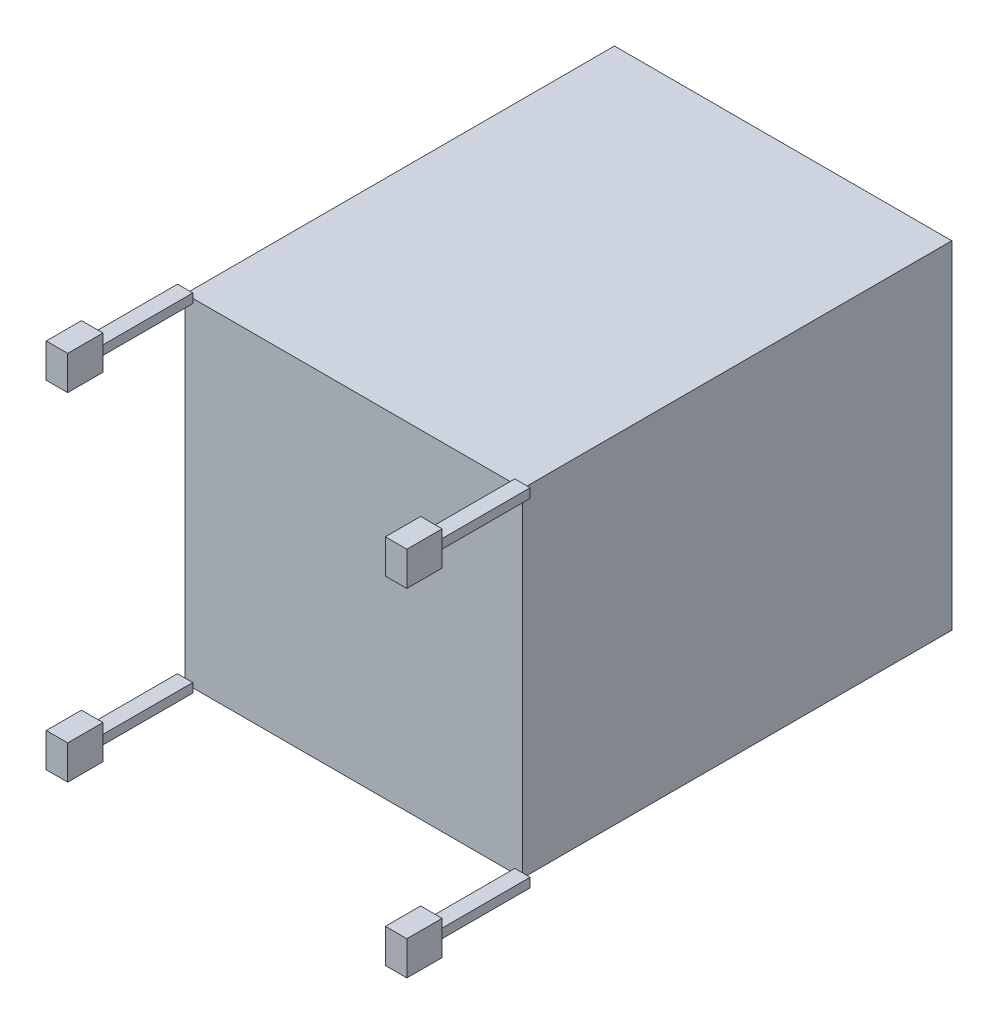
ISO-10303-21;
HEADER;
FILE_DESCRIPTION(('STEP AP214'),'2;1');
FILE_NAME('part.step','',(''),(''),'','','');
FILE_SCHEMA(('AUTOMOTIVE_DESIGN { 1 0 10303 214 1 1 1 1 }'));
ENDSEC;
DATA;
#1=APPLICATION_CONTEXT('core data for automotive mechanical design processes');
#2=APPLICATION_PROTOCOL_DEFINITION('international standard','automotive_design',2000,#1);
#3=PRODUCT_CONTEXT('',#1,'mechanical');
#4=PRODUCT('Part','Part','',(#3));
#5=PRODUCT_RELATED_PRODUCT_CATEGORY('part','',(#4));
#6=PRODUCT_DEFINITION_FORMATION('','',#4);
#7=PRODUCT_DEFINITION_CONTEXT('part definition',#1,'design');
#8=PRODUCT_DEFINITION('design','',#6,#7);
#9=PRODUCT_DEFINITION_SHAPE('','',#8);
#10=(LENGTH_UNIT() NAMED_UNIT(*) SI_UNIT(.MILLI.,.METRE.));
#11=(NAMED_UNIT(*) PLANE_ANGLE_UNIT() SI_UNIT($,.RADIAN.));
#12=(NAMED_UNIT(*) SI_UNIT($,.STERADIAN.) SOLID_ANGLE_UNIT());
#13=UNCERTAINTY_MEASURE_WITH_UNIT(LENGTH_MEASURE(1.E-05),#10,'distance_accuracy_value','');
#14=(GEOMETRIC_REPRESENTATION_CONTEXT(3) GLOBAL_UNCERTAINTY_ASSIGNED_CONTEXT((#13)) GLOBAL_UNIT_ASSIGNED_CONTEXT((#10,
#11,#12)) REPRESENTATION_CONTEXT('',''));
#15=CARTESIAN_POINT('',(0.,0.,0.));
#16=DIRECTION('',(0.,0.,1.));
#17=DIRECTION('',(1.,0.,0.));
#18=AXIS2_PLACEMENT_3D('',#15,#16,#17);
#19=CARTESIAN_POINT('',(5100.,-1000.,5400.));
#20=DIRECTION('',(0.,0.,1.));
#21=DIRECTION('',(1.,0.,0.));
#22=AXIS2_PLACEMENT_3D('',#19,#20,#21);
#23=PLANE('',#22);
#24=DIRECTION('',(-1.,0.,0.));
#25=VECTOR('',#24,1.);
#26=CARTESIAN_POINT('',(5100.,-1550.,5400.));
#27=LINE('',#26,#25);
#28=CARTESIAN_POINT('',(5650.,-1550.,5400.));
#29=VERTEX_POINT('',#28);
#30=CARTESIAN_POINT('',(4550.,-1550.,5400.));
#31=VERTEX_POINT('',#30);
#32=EDGE_CURVE('P0_E11',#29,#31,#27,.T.);
#33=ORIENTED_EDGE('',*,*,#32,.F.);
#34=DIRECTION('',(0.,-1.,0.));
#35=VECTOR('',#34,1.);
#36=CARTESIAN_POINT('',(5650.,-1000.,5400.));
#37=LINE('',#36,#35);
#38=CARTESIAN_POINT('',(5650.,-450.,5400.));
#39=VERTEX_POINT('',#38);
#40=EDGE_CURVE('P0_E61',#39,#29,#37,.T.);
#41=ORIENTED_EDGE('',*,*,#40,.F.);
#42=DIRECTION('',(1.,0.,0.));
#43=VECTOR('',#42,1.);
#44=CARTESIAN_POINT('',(5100.,-450.,5400.));
#45=LINE('',#44,#43);
#46=CARTESIAN_POINT('',(4550.,-450.,5400.));
#47=VERTEX_POINT('',#46);
#48=EDGE_CURVE('P0_E87',#47,#39,#45,.T.);
#49=ORIENTED_EDGE('',*,*,#48,.F.);
#50=DIRECTION('',(0.,1.,0.));
#51=VECTOR('',#50,1.);
#52=CARTESIAN_POINT('',(4550.,-1000.,5400.));
#53=LINE('',#52,#51);
#54=EDGE_CURVE('P0_E24',#31,#47,#53,.T.);
#55=ORIENTED_EDGE('',*,*,#54,.F.);
#56=EDGE_LOOP('',(#33,#41,#49,#55));
#57=FACE_BOUND('',#56,.T.);
#58=ADVANCED_FACE('P0_F17',(#57),#23,.T.);
#59=CARTESIAN_POINT('',(5100.,-1550.,4000.));
#60=DIRECTION('',(0.,-1.,0.));
#61=DIRECTION('',(0.,0.,-1.));
#62=AXIS2_PLACEMENT_3D('',#59,#60,#61);
#63=PLANE('',#62);
#64=DIRECTION('',(0.,0.,1.));
#65=VECTOR('',#64,1.);
#66=CARTESIAN_POINT('',(5650.,-1550.,4000.));
#67=LINE('',#66,#65);
#68=CARTESIAN_POINT('',(5650.,-1550.,4000.));
#69=VERTEX_POINT('',#68);
#70=EDGE_CURVE('P0_E53',#69,#29,#67,.T.);
#71=ORIENTED_EDGE('',*,*,#70,.T.);
#72=ORIENTED_EDGE('',*,*,#32,.T.);
#73=DIRECTION('',(0.,0.,1.));
#74=VECTOR('',#73,1.);
#75=CARTESIAN_POINT('',(4550.,-1550.,4000.));
#76=LINE('',#75,#74);
#77=CARTESIAN_POINT('',(4550.,-1550.,4000.));
#78=VERTEX_POINT('',#77);
#79=EDGE_CURVE('P0_E70',#78,#31,#76,.T.);
#80=ORIENTED_EDGE('',*,*,#79,.F.);
#81=DIRECTION('',(1.,0.,0.));
#82=VECTOR('',#81,1.);
#83=CARTESIAN_POINT('',(5100.,-1550.,4000.));
#84=LINE('',#83,#82);
#85=EDGE_CURVE('P0_E65',#78,#69,#84,.T.);
#86=ORIENTED_EDGE('',*,*,#85,.T.);
#87=EDGE_LOOP('',(#71,#72,#80,#86));
#88=FACE_BOUND('',#87,.T.);
#89=ADVANCED_FACE('P0_F66',(#88),#63,.T.);
#90=CARTESIAN_POINT('',(4550.,-1000.,4000.));
#91=DIRECTION('',(-1.,0.,0.));
#92=DIRECTION('',(0.,0.,1.));
#93=AXIS2_PLACEMENT_3D('',#90,#91,#92);
#94=PLANE('',#93);
#95=ORIENTED_EDGE('',*,*,#79,.T.);
#96=ORIENTED_EDGE('',*,*,#54,.T.);
#97=DIRECTION('',(0.,0.,1.));
#98=VECTOR('',#97,1.);
#99=CARTESIAN_POINT('',(4550.,-450.,4000.));
#100=LINE('',#99,#98);
#101=CARTESIAN_POINT('',(4550.,-450.,4000.));
#102=VERTEX_POINT('',#101);
#103=EDGE_CURVE('P0_E85',#102,#47,#100,.T.);
#104=ORIENTED_EDGE('',*,*,#103,.F.);
#105=DIRECTION('',(0.,-1.,0.));
#106=VECTOR('',#105,1.);
#107=CARTESIAN_POINT('',(4550.,-1000.,4000.));
#108=LINE('',#107,#106);
#109=EDGE_CURVE('P0_E75',#102,#78,#108,.T.);
#110=ORIENTED_EDGE('',*,*,#109,.T.);
#111=EDGE_LOOP('',(#95,#96,#104,#110));
#112=FACE_BOUND('',#111,.T.);
#113=ADVANCED_FACE('P0_F93',(#112),#94,.T.);
#114=CARTESIAN_POINT('',(5100.,-450.,4000.));
#115=DIRECTION('',(0.,1.,0.));
#116=DIRECTION('',(0.,0.,1.));
#117=AXIS2_PLACEMENT_3D('',#114,#115,#116);
#118=PLANE('',#117);
#119=ORIENTED_EDGE('',*,*,#103,.T.);
#120=ORIENTED_EDGE('',*,*,#48,.T.);
#121=DIRECTION('',(0.,0.,1.));
#122=VECTOR('',#121,1.);
#123=CARTESIAN_POINT('',(5650.,-450.,4000.));
#124=LINE('',#123,#122);
#125=CARTESIAN_POINT('',(5650.,-450.,4000.));
#126=VERTEX_POINT('',#125);
#127=EDGE_CURVE('P0_E62',#126,#39,#124,.T.);
#128=ORIENTED_EDGE('',*,*,#127,.F.);
#129=DIRECTION('',(-1.,0.,0.));
#130=VECTOR('',#129,1.);
#131=CARTESIAN_POINT('',(5100.,-450.,4000.));
#132=LINE('',#131,#130);
#133=EDGE_CURVE('P0_E76',#126,#102,#132,.T.);
#134=ORIENTED_EDGE('',*,*,#133,.T.);
#135=EDGE_LOOP('',(#119,#120,#128,#134));
#136=FACE_BOUND('',#135,.T.);
#137=ADVANCED_FACE('P0_F90',(#136),#118,.T.);
#138=CARTESIAN_POINT('',(5100.,-1000.,4000.));
#139=DIRECTION('',(0.,0.,-1.));
#140=DIRECTION('',(-1.,0.,0.));
#141=AXIS2_PLACEMENT_3D('',#138,#139,#140);
#142=PLANE('',#141);
#143=DIRECTION('',(0.,1.,0.));
#144=VECTOR('',#143,1.);
#145=CARTESIAN_POINT('',(5650.,-1000.,4000.));
#146=LINE('',#145,#144);
#147=EDGE_CURVE('P0_E56',#69,#126,#146,.T.);
#148=ORIENTED_EDGE('',*,*,#147,.F.);
#149=ORIENTED_EDGE('',*,*,#85,.F.);
#150=ORIENTED_EDGE('',*,*,#109,.F.);
#151=ORIENTED_EDGE('',*,*,#133,.F.);
#152=EDGE_LOOP('',(#148,#149,#150,#151));
#153=FACE_BOUND('',#152,.T.);
#154=ADVANCED_FACE('P0_F72',(#153),#142,.T.);
#155=CARTESIAN_POINT('',(5650.,-1000.,4000.));
#156=DIRECTION('',(1.,0.,0.));
#157=DIRECTION('',(0.,0.,-1.));
#158=AXIS2_PLACEMENT_3D('',#155,#156,#157);
#159=PLANE('',#158);
#160=ORIENTED_EDGE('',*,*,#147,.T.);
#161=ORIENTED_EDGE('',*,*,#127,.T.);
#162=ORIENTED_EDGE('',*,*,#40,.T.);
#163=ORIENTED_EDGE('',*,*,#70,.F.);
#164=EDGE_LOOP('',(#160,#161,#162,#163));
#165=FACE_BOUND('',#164,.T.);
#166=ADVANCED_FACE('P0_F57',(#165),#159,.T.);
#167=CLOSED_SHELL('',(#58,#89,#113,#137,#154,#166));
#168=MANIFOLD_SOLID_BREP('P0_B1',#167);
#169=CARTESIAN_POINT('',(4550.,-1550.,5730.));
#170=DIRECTION('',(0.,0.,1.));
#171=DIRECTION('',(1.,0.,0.));
#172=AXIS2_PLACEMENT_3D('',#169,#170,#171);
#173=PLANE('',#172);
#174=DIRECTION('',(-1.,0.,0.));
#175=VECTOR('',#174,1.);
#176=CARTESIAN_POINT('',(4550.,-1565.,5730.));
#177=LINE('',#176,#175);
#178=CARTESIAN_POINT('',(4575.,-1565.,5730.));
#179=VERTEX_POINT('',#178);
#180=CARTESIAN_POINT('',(4525.,-1565.,5730.));
#181=VERTEX_POINT('',#180);
#182=EDGE_CURVE('P1_E11',#179,#181,#177,.T.);
#183=ORIENTED_EDGE('',*,*,#182,.F.);
#184=DIRECTION('',(0.,-1.,0.));
#185=VECTOR('',#184,1.);
#186=CARTESIAN_POINT('',(4575.,-1550.,5730.));
#187=LINE('',#186,#185);
#188=CARTESIAN_POINT('',(4575.,-1535.,5730.));
#189=VERTEX_POINT('',#188);
#190=EDGE_CURVE('P1_E61',#189,#179,#187,.T.);
#191=ORIENTED_EDGE('',*,*,#190,.F.);
#192=DIRECTION('',(1.,0.,0.));
#193=VECTOR('',#192,1.);
#194=CARTESIAN_POINT('',(4550.,-1535.,5730.));
#195=LINE('',#194,#193);
#196=CARTESIAN_POINT('',(4525.,-1535.,5730.));
#197=VERTEX_POINT('',#196);
#198=EDGE_CURVE('P1_E87',#197,#189,#195,.T.);
#199=ORIENTED_EDGE('',*,*,#198,.F.);
#200=DIRECTION('',(0.,1.,0.));
#201=VECTOR('',#200,1.);
#202=CARTESIAN_POINT('',(4525.,-1550.,5730.));
#203=LINE('',#202,#201);
#204=EDGE_CURVE('P1_E24',#181,#197,#203,.T.);
#205=ORIENTED_EDGE('',*,*,#204,.F.);
#206=EDGE_LOOP('',(#183,#191,#199,#205));
#207=FACE_BOUND('',#206,.T.);
#208=ADVANCED_FACE('P1_F17',(#207),#173,.T.);
#209=CARTESIAN_POINT('',(4550.,-1565.,5400.));
#210=DIRECTION('',(0.,-1.,0.));
#211=DIRECTION('',(0.,0.,-1.));
#212=AXIS2_PLACEMENT_3D('',#209,#210,#211);
#213=PLANE('',#212);
#214=DIRECTION('',(0.,0.,1.));
#215=VECTOR('',#214,1.);
#216=CARTESIAN_POINT('',(4575.,-1565.,5400.));
#217=LINE('',#216,#215);
#218=CARTESIAN_POINT('',(4575.,-1565.,5400.));
#219=VERTEX_POINT('',#218);
#220=EDGE_CURVE('P1_E53',#219,#179,#217,.T.);
#221=ORIENTED_EDGE('',*,*,#220,.T.);
#222=ORIENTED_EDGE('',*,*,#182,.T.);
#223=DIRECTION('',(0.,0.,1.));
#224=VECTOR('',#223,1.);
#225=CARTESIAN_POINT('',(4525.,-1565.,5400.));
#226=LINE('',#225,#224);
#227=CARTESIAN_POINT('',(4525.,-1565.,5400.));
#228=VERTEX_POINT('',#227);
#229=EDGE_CURVE('P1_E70',#228,#181,#226,.T.);
#230=ORIENTED_EDGE('',*,*,#229,.F.);
#231=DIRECTION('',(1.,0.,0.));
#232=VECTOR('',#231,1.);
#233=CARTESIAN_POINT('',(4550.,-1565.,5400.));
#234=LINE('',#233,#232);
#235=EDGE_CURVE('P1_E65',#228,#219,#234,.T.);
#236=ORIENTED_EDGE('',*,*,#235,.T.);
#237=EDGE_LOOP('',(#221,#222,#230,#236));
#238=FACE_BOUND('',#237,.T.);
#239=ADVANCED_FACE('P1_F66',(#238),#213,.T.);
#240=CARTESIAN_POINT('',(4525.,-1550.,5400.));
#241=DIRECTION('',(-1.,0.,0.));
#242=DIRECTION('',(0.,0.,1.));
#243=AXIS2_PLACEMENT_3D('',#240,#241,#242);
#244=PLANE('',#243);
#245=ORIENTED_EDGE('',*,*,#229,.T.);
#246=ORIENTED_EDGE('',*,*,#204,.T.);
#247=DIRECTION('',(0.,0.,1.));
#248=VECTOR('',#247,1.);
#249=CARTESIAN_POINT('',(4525.,-1535.,5400.));
#250=LINE('',#249,#248);
#251=CARTESIAN_POINT('',(4525.,-1535.,5400.));
#252=VERTEX_POINT('',#251);
#253=EDGE_CURVE('P1_E85',#252,#197,#250,.T.);
#254=ORIENTED_EDGE('',*,*,#253,.F.);
#255=DIRECTION('',(0.,-1.,0.));
#256=VECTOR('',#255,1.);
#257=CARTESIAN_POINT('',(4525.,-1550.,5400.));
#258=LINE('',#257,#256);
#259=EDGE_CURVE('P1_E75',#252,#228,#258,.T.);
#260=ORIENTED_EDGE('',*,*,#259,.T.);
#261=EDGE_LOOP('',(#245,#246,#254,#260));
#262=FACE_BOUND('',#261,.T.);
#263=ADVANCED_FACE('P1_F93',(#262),#244,.T.);
#264=CARTESIAN_POINT('',(4550.,-1535.,5400.));
#265=DIRECTION('',(0.,1.,0.));
#266=DIRECTION('',(0.,0.,1.));
#267=AXIS2_PLACEMENT_3D('',#264,#265,#266);
#268=PLANE('',#267);
#269=ORIENTED_EDGE('',*,*,#253,.T.);
#270=ORIENTED_EDGE('',*,*,#198,.T.);
#271=DIRECTION('',(0.,0.,1.));
#272=VECTOR('',#271,1.);
#273=CARTESIAN_POINT('',(4575.,-1535.,5400.));
#274=LINE('',#273,#272);
#275=CARTESIAN_POINT('',(4575.,-1535.,5400.));
#276=VERTEX_POINT('',#275);
#277=EDGE_CURVE('P1_E62',#276,#189,#274,.T.);
#278=ORIENTED_EDGE('',*,*,#277,.F.);
#279=DIRECTION('',(-1.,0.,0.));
#280=VECTOR('',#279,1.);
#281=CARTESIAN_POINT('',(4550.,-1535.,5400.));
#282=LINE('',#281,#280);
#283=EDGE_CURVE('P1_E76',#276,#252,#282,.T.);
#284=ORIENTED_EDGE('',*,*,#283,.T.);
#285=EDGE_LOOP('',(#269,#270,#278,#284));
#286=FACE_BOUND('',#285,.T.);
#287=ADVANCED_FACE('P1_F90',(#286),#268,.T.);
#288=CARTESIAN_POINT('',(4550.,-1550.,5400.));
#289=DIRECTION('',(0.,0.,-1.));
#290=DIRECTION('',(-1.,0.,0.));
#291=AXIS2_PLACEMENT_3D('',#288,#289,#290);
#292=PLANE('',#291);
#293=DIRECTION('',(0.,1.,0.));
#294=VECTOR('',#293,1.);
#295=CARTESIAN_POINT('',(4575.,-1550.,5400.));
#296=LINE('',#295,#294);
#297=EDGE_CURVE('P1_E56',#219,#276,#296,.T.);
#298=ORIENTED_EDGE('',*,*,#297,.F.);
#299=ORIENTED_EDGE('',*,*,#235,.F.);
#300=ORIENTED_EDGE('',*,*,#259,.F.);
#301=ORIENTED_EDGE('',*,*,#283,.F.);
#302=EDGE_LOOP('',(#298,#299,#300,#301));
#303=FACE_BOUND('',#302,.T.);
#304=ADVANCED_FACE('P1_F72',(#303),#292,.T.);
#305=CARTESIAN_POINT('',(4575.,-1550.,5400.));
#306=DIRECTION('',(1.,0.,0.));
#307=DIRECTION('',(0.,0.,-1.));
#308=AXIS2_PLACEMENT_3D('',#305,#306,#307);
#309=PLANE('',#308);
#310=ORIENTED_EDGE('',*,*,#297,.T.);
#311=ORIENTED_EDGE('',*,*,#277,.T.);
#312=ORIENTED_EDGE('',*,*,#190,.T.);
#313=ORIENTED_EDGE('',*,*,#220,.F.);
#314=EDGE_LOOP('',(#310,#311,#312,#313));
#315=FACE_BOUND('',#314,.T.);
#316=ADVANCED_FACE('P1_F57',(#315),#309,.T.);
#317=CLOSED_SHELL('',(#208,#239,#263,#287,#304,#316));
#318=MANIFOLD_SOLID_BREP('P1_B1',#317);
#319=CARTESIAN_POINT('',(4547.,-1550.,5815.));
#320=DIRECTION('',(0.,0.,1.));
#321=DIRECTION('',(1.,0.,0.));
#322=AXIS2_PLACEMENT_3D('',#319,#320,#321);
#323=PLANE('',#322);
#324=DIRECTION('',(-1.,0.,0.));
#325=VECTOR('',#324,1.);
#326=CARTESIAN_POINT('',(4547.,-1605.5,5815.));
#327=LINE('',#326,#325);
#328=CARTESIAN_POINT('',(4582.,-1605.5,5815.));
#329=VERTEX_POINT('',#328);
#330=CARTESIAN_POINT('',(4512.,-1605.5,5815.));
#331=VERTEX_POINT('',#330);
#332=EDGE_CURVE('P2_E11',#329,#331,#327,.T.);
#333=ORIENTED_EDGE('',*,*,#332,.F.);
#334=DIRECTION('',(0.,-1.,0.));
#335=VECTOR('',#334,1.);
#336=CARTESIAN_POINT('',(4582.,-1550.,5815.));
#337=LINE('',#336,#335);
#338=CARTESIAN_POINT('',(4582.,-1494.5,5815.));
#339=VERTEX_POINT('',#338);
#340=EDGE_CURVE('P2_E61',#339,#329,#337,.T.);
#341=ORIENTED_EDGE('',*,*,#340,.F.);
#342=DIRECTION('',(1.,0.,0.));
#343=VECTOR('',#342,1.);
#344=CARTESIAN_POINT('',(4547.,-1494.5,5815.));
#345=LINE('',#344,#343);
#346=CARTESIAN_POINT('',(4512.,-1494.5,5815.));
#347=VERTEX_POINT('',#346);
#348=EDGE_CURVE('P2_E87',#347,#339,#345,.T.);
#349=ORIENTED_EDGE('',*,*,#348,.F.);
#350=DIRECTION('',(0.,1.,0.));
#351=VECTOR('',#350,1.);
#352=CARTESIAN_POINT('',(4512.,-1550.,5815.));
#353=LINE('',#352,#351);
#354=EDGE_CURVE('P2_E24',#331,#347,#353,.T.);
#355=ORIENTED_EDGE('',*,*,#354,.F.);
#356=EDGE_LOOP('',(#333,#341,#349,#355));
#357=FACE_BOUND('',#356,.T.);
#358=ADVANCED_FACE('P2_F17',(#357),#323,.T.);
#359=CARTESIAN_POINT('',(4547.,-1605.5,5700.));
#360=DIRECTION('',(0.,-1.,0.));
#361=DIRECTION('',(0.,0.,-1.));
#362=AXIS2_PLACEMENT_3D('',#359,#360,#361);
#363=PLANE('',#362);
#364=DIRECTION('',(0.,0.,1.));
#365=VECTOR('',#364,1.);
#366=CARTESIAN_POINT('',(4582.,-1605.5,5700.));
#367=LINE('',#366,#365);
#368=CARTESIAN_POINT('',(4582.,-1605.5,5700.));
#369=VERTEX_POINT('',#368);
#370=EDGE_CURVE('P2_E53',#369,#329,#367,.T.);
#371=ORIENTED_EDGE('',*,*,#370,.T.);
#372=ORIENTED_EDGE('',*,*,#332,.T.);
#373=DIRECTION('',(0.,0.,1.));
#374=VECTOR('',#373,1.);
#375=CARTESIAN_POINT('',(4512.,-1605.5,5700.));
#376=LINE('',#375,#374);
#377=CARTESIAN_POINT('',(4512.,-1605.5,5700.));
#378=VERTEX_POINT('',#377);
#379=EDGE_CURVE('P2_E70',#378,#331,#376,.T.);
#380=ORIENTED_EDGE('',*,*,#379,.F.);
#381=DIRECTION('',(1.,0.,0.));
#382=VECTOR('',#381,1.);
#383=CARTESIAN_POINT('',(4547.,-1605.5,5700.));
#384=LINE('',#383,#382);
#385=EDGE_CURVE('P2_E65',#378,#369,#384,.T.);
#386=ORIENTED_EDGE('',*,*,#385,.T.);
#387=EDGE_LOOP('',(#371,#372,#380,#386));
#388=FACE_BOUND('',#387,.T.);
#389=ADVANCED_FACE('P2_F66',(#388),#363,.T.);
#390=CARTESIAN_POINT('',(4512.,-1550.,5700.));
#391=DIRECTION('',(-1.,0.,0.));
#392=DIRECTION('',(0.,0.,1.));
#393=AXIS2_PLACEMENT_3D('',#390,#391,#392);
#394=PLANE('',#393);
#395=ORIENTED_EDGE('',*,*,#379,.T.);
#396=ORIENTED_EDGE('',*,*,#354,.T.);
#397=DIRECTION('',(0.,0.,1.));
#398=VECTOR('',#397,1.);
#399=CARTESIAN_POINT('',(4512.,-1494.5,5700.));
#400=LINE('',#399,#398);
#401=CARTESIAN_POINT('',(4512.,-1494.5,5700.));
#402=VERTEX_POINT('',#401);
#403=EDGE_CURVE('P2_E85',#402,#347,#400,.T.);
#404=ORIENTED_EDGE('',*,*,#403,.F.);
#405=DIRECTION('',(0.,-1.,0.));
#406=VECTOR('',#405,1.);
#407=CARTESIAN_POINT('',(4512.,-1550.,5700.));
#408=LINE('',#407,#406);
#409=EDGE_CURVE('P2_E75',#402,#378,#408,.T.);
#410=ORIENTED_EDGE('',*,*,#409,.T.);
#411=EDGE_LOOP('',(#395,#396,#404,#410));
#412=FACE_BOUND('',#411,.T.);
#413=ADVANCED_FACE('P2_F93',(#412),#394,.T.);
#414=CARTESIAN_POINT('',(4547.,-1494.5,5700.));
#415=DIRECTION('',(0.,1.,0.));
#416=DIRECTION('',(0.,0.,1.));
#417=AXIS2_PLACEMENT_3D('',#414,#415,#416);
#418=PLANE('',#417);
#419=ORIENTED_EDGE('',*,*,#403,.T.);
#420=ORIENTED_EDGE('',*,*,#348,.T.);
#421=DIRECTION('',(0.,0.,1.));
#422=VECTOR('',#421,1.);
#423=CARTESIAN_POINT('',(4582.,-1494.5,5700.));
#424=LINE('',#423,#422);
#425=CARTESIAN_POINT('',(4582.,-1494.5,5700.));
#426=VERTEX_POINT('',#425);
#427=EDGE_CURVE('P2_E62',#426,#339,#424,.T.);
#428=ORIENTED_EDGE('',*,*,#427,.F.);
#429=DIRECTION('',(-1.,0.,0.));
#430=VECTOR('',#429,1.);
#431=CARTESIAN_POINT('',(4547.,-1494.5,5700.));
#432=LINE('',#431,#430);
#433=EDGE_CURVE('P2_E76',#426,#402,#432,.T.);
#434=ORIENTED_EDGE('',*,*,#433,.T.);
#435=EDGE_LOOP('',(#419,#420,#428,#434));
#436=FACE_BOUND('',#435,.T.);
#437=ADVANCED_FACE('P2_F90',(#436),#418,.T.);
#438=CARTESIAN_POINT('',(4547.,-1550.,5700.));
#439=DIRECTION('',(0.,0.,-1.));
#440=DIRECTION('',(-1.,0.,0.));
#441=AXIS2_PLACEMENT_3D('',#438,#439,#440);
#442=PLANE('',#441);
#443=DIRECTION('',(0.,1.,0.));
#444=VECTOR('',#443,1.);
#445=CARTESIAN_POINT('',(4582.,-1550.,5700.));
#446=LINE('',#445,#444);
#447=EDGE_CURVE('P2_E56',#369,#426,#446,.T.);
#448=ORIENTED_EDGE('',*,*,#447,.F.);
#449=ORIENTED_EDGE('',*,*,#385,.F.);
#450=ORIENTED_EDGE('',*,*,#409,.F.);
#451=ORIENTED_EDGE('',*,*,#433,.F.);
#452=EDGE_LOOP('',(#448,#449,#450,#451));
#453=FACE_BOUND('',#452,.T.);
#454=ADVANCED_FACE('P2_F72',(#453),#442,.T.);
#455=CARTESIAN_POINT('',(4582.,-1550.,5700.));
#456=DIRECTION('',(1.,0.,0.));
#457=DIRECTION('',(0.,0.,-1.));
#458=AXIS2_PLACEMENT_3D('',#455,#456,#457);
#459=PLANE('',#458);
#460=ORIENTED_EDGE('',*,*,#447,.T.);
#461=ORIENTED_EDGE('',*,*,#427,.T.);
#462=ORIENTED_EDGE('',*,*,#340,.T.);
#463=ORIENTED_EDGE('',*,*,#370,.F.);
#464=EDGE_LOOP('',(#460,#461,#462,#463));
#465=FACE_BOUND('',#464,.T.);
#466=ADVANCED_FACE('P2_F57',(#465),#459,.T.);
#467=CLOSED_SHELL('',(#358,#389,#413,#437,#454,#466));
#468=MANIFOLD_SOLID_BREP('P2_B1',#467);
#469=CARTESIAN_POINT('',(4550.,-450.,5730.));
#470=DIRECTION('',(0.,0.,1.));
#471=DIRECTION('',(1.,0.,0.));
#472=AXIS2_PLACEMENT_3D('',#469,#470,#471);
#473=PLANE('',#472);
#474=DIRECTION('',(-1.,0.,0.));
#475=VECTOR('',#474,1.);
#476=CARTESIAN_POINT('',(4550.,-465.,5730.));
#477=LINE('',#476,#475);
#478=CARTESIAN_POINT('',(4575.,-465.,5730.));
#479=VERTEX_POINT('',#478);
#480=CARTESIAN_POINT('',(4525.,-465.,5730.));
#481=VERTEX_POINT('',#480);
#482=EDGE_CURVE('P3_E11',#479,#481,#477,.T.);
#483=ORIENTED_EDGE('',*,*,#482,.F.);
#484=DIRECTION('',(0.,-1.,0.));
#485=VECTOR('',#484,1.);
#486=CARTESIAN_POINT('',(4575.,-450.,5730.));
#487=LINE('',#486,#485);
#488=CARTESIAN_POINT('',(4575.,-435.,5730.));
#489=VERTEX_POINT('',#488);
#490=EDGE_CURVE('P3_E61',#489,#479,#487,.T.);
#491=ORIENTED_EDGE('',*,*,#490,.F.);
#492=DIRECTION('',(1.,0.,0.));
#493=VECTOR('',#492,1.);
#494=CARTESIAN_POINT('',(4550.,-435.,5730.));
#495=LINE('',#494,#493);
#496=CARTESIAN_POINT('',(4525.,-435.,5730.));
#497=VERTEX_POINT('',#496);
#498=EDGE_CURVE('P3_E87',#497,#489,#495,.T.);
#499=ORIENTED_EDGE('',*,*,#498,.F.);
#500=DIRECTION('',(0.,1.,0.));
#501=VECTOR('',#500,1.);
#502=CARTESIAN_POINT('',(4525.,-450.,5730.));
#503=LINE('',#502,#501);
#504=EDGE_CURVE('P3_E24',#481,#497,#503,.T.);
#505=ORIENTED_EDGE('',*,*,#504,.F.);
#506=EDGE_LOOP('',(#483,#491,#499,#505));
#507=FACE_BOUND('',#506,.T.);
#508=ADVANCED_FACE('P3_F17',(#507),#473,.T.);
#509=CARTESIAN_POINT('',(4550.,-465.,5400.));
#510=DIRECTION('',(0.,-1.,0.));
#511=DIRECTION('',(0.,0.,-1.));
#512=AXIS2_PLACEMENT_3D('',#509,#510,#511);
#513=PLANE('',#512);
#514=DIRECTION('',(0.,0.,1.));
#515=VECTOR('',#514,1.);
#516=CARTESIAN_POINT('',(4575.,-465.,5400.));
#517=LINE('',#516,#515);
#518=CARTESIAN_POINT('',(4575.,-465.,5400.));
#519=VERTEX_POINT('',#518);
#520=EDGE_CURVE('P3_E53',#519,#479,#517,.T.);
#521=ORIENTED_EDGE('',*,*,#520,.T.);
#522=ORIENTED_EDGE('',*,*,#482,.T.);
#523=DIRECTION('',(0.,0.,1.));
#524=VECTOR('',#523,1.);
#525=CARTESIAN_POINT('',(4525.,-465.,5400.));
#526=LINE('',#525,#524);
#527=CARTESIAN_POINT('',(4525.,-465.,5400.));
#528=VERTEX_POINT('',#527);
#529=EDGE_CURVE('P3_E70',#528,#481,#526,.T.);
#530=ORIENTED_EDGE('',*,*,#529,.F.);
#531=DIRECTION('',(1.,0.,0.));
#532=VECTOR('',#531,1.);
#533=CARTESIAN_POINT('',(4550.,-465.,5400.));
#534=LINE('',#533,#532);
#535=EDGE_CURVE('P3_E65',#528,#519,#534,.T.);
#536=ORIENTED_EDGE('',*,*,#535,.T.);
#537=EDGE_LOOP('',(#521,#522,#530,#536));
#538=FACE_BOUND('',#537,.T.);
#539=ADVANCED_FACE('P3_F66',(#538),#513,.T.);
#540=CARTESIAN_POINT('',(4525.,-450.,5400.));
#541=DIRECTION('',(-1.,0.,0.));
#542=DIRECTION('',(0.,0.,1.));
#543=AXIS2_PLACEMENT_3D('',#540,#541,#542);
#544=PLANE('',#543);
#545=ORIENTED_EDGE('',*,*,#529,.T.);
#546=ORIENTED_EDGE('',*,*,#504,.T.);
#547=DIRECTION('',(0.,0.,1.));
#548=VECTOR('',#547,1.);
#549=CARTESIAN_POINT('',(4525.,-435.,5400.));
#550=LINE('',#549,#548);
#551=CARTESIAN_POINT('',(4525.,-435.,5400.));
#552=VERTEX_POINT('',#551);
#553=EDGE_CURVE('P3_E85',#552,#497,#550,.T.);
#554=ORIENTED_EDGE('',*,*,#553,.F.);
#555=DIRECTION('',(0.,-1.,0.));
#556=VECTOR('',#555,1.);
#557=CARTESIAN_POINT('',(4525.,-450.,5400.));
#558=LINE('',#557,#556);
#559=EDGE_CURVE('P3_E75',#552,#528,#558,.T.);
#560=ORIENTED_EDGE('',*,*,#559,.T.);
#561=EDGE_LOOP('',(#545,#546,#554,#560));
#562=FACE_BOUND('',#561,.T.);
#563=ADVANCED_FACE('P3_F93',(#562),#544,.T.);
#564=CARTESIAN_POINT('',(4550.,-435.,5400.));
#565=DIRECTION('',(0.,1.,0.));
#566=DIRECTION('',(0.,0.,1.));
#567=AXIS2_PLACEMENT_3D('',#564,#565,#566);
#568=PLANE('',#567);
#569=ORIENTED_EDGE('',*,*,#553,.T.);
#570=ORIENTED_EDGE('',*,*,#498,.T.);
#571=DIRECTION('',(0.,0.,1.));
#572=VECTOR('',#571,1.);
#573=CARTESIAN_POINT('',(4575.,-435.,5400.));
#574=LINE('',#573,#572);
#575=CARTESIAN_POINT('',(4575.,-435.,5400.));
#576=VERTEX_POINT('',#575);
#577=EDGE_CURVE('P3_E62',#576,#489,#574,.T.);
#578=ORIENTED_EDGE('',*,*,#577,.F.);
#579=DIRECTION('',(-1.,0.,0.));
#580=VECTOR('',#579,1.);
#581=CARTESIAN_POINT('',(4550.,-435.,5400.));
#582=LINE('',#581,#580);
#583=EDGE_CURVE('P3_E76',#576,#552,#582,.T.);
#584=ORIENTED_EDGE('',*,*,#583,.T.);
#585=EDGE_LOOP('',(#569,#570,#578,#584));
#586=FACE_BOUND('',#585,.T.);
#587=ADVANCED_FACE('P3_F90',(#586),#568,.T.);
#588=CARTESIAN_POINT('',(4550.,-450.,5400.));
#589=DIRECTION('',(0.,0.,-1.));
#590=DIRECTION('',(-1.,0.,0.));
#591=AXIS2_PLACEMENT_3D('',#588,#589,#590);
#592=PLANE('',#591);
#593=DIRECTION('',(0.,1.,0.));
#594=VECTOR('',#593,1.);
#595=CARTESIAN_POINT('',(4575.,-450.,5400.));
#596=LINE('',#595,#594);
#597=EDGE_CURVE('P3_E56',#519,#576,#596,.T.);
#598=ORIENTED_EDGE('',*,*,#597,.F.);
#599=ORIENTED_EDGE('',*,*,#535,.F.);
#600=ORIENTED_EDGE('',*,*,#559,.F.);
#601=ORIENTED_EDGE('',*,*,#583,.F.);
#602=EDGE_LOOP('',(#598,#599,#600,#601));
#603=FACE_BOUND('',#602,.T.);
#604=ADVANCED_FACE('P3_F72',(#603),#592,.T.);
#605=CARTESIAN_POINT('',(4575.,-450.,5400.));
#606=DIRECTION('',(1.,0.,0.));
#607=DIRECTION('',(0.,0.,-1.));
#608=AXIS2_PLACEMENT_3D('',#605,#606,#607);
#609=PLANE('',#608);
#610=ORIENTED_EDGE('',*,*,#597,.T.);
#611=ORIENTED_EDGE('',*,*,#577,.T.);
#612=ORIENTED_EDGE('',*,*,#490,.T.);
#613=ORIENTED_EDGE('',*,*,#520,.F.);
#614=EDGE_LOOP('',(#610,#611,#612,#613));
#615=FACE_BOUND('',#614,.T.);
#616=ADVANCED_FACE('P3_F57',(#615),#609,.T.);
#617=CLOSED_SHELL('',(#508,#539,#563,#587,#604,#616));
#618=MANIFOLD_SOLID_BREP('P3_B1',#617);
#619=CARTESIAN_POINT('',(4547.,-450.,5815.));
#620=DIRECTION('',(0.,0.,1.));
#621=DIRECTION('',(1.,0.,0.));
#622=AXIS2_PLACEMENT_3D('',#619,#620,#621);
#623=PLANE('',#622);
#624=DIRECTION('',(-1.,0.,0.));
#625=VECTOR('',#624,1.);
#626=CARTESIAN_POINT('',(4547.,-505.5,5815.));
#627=LINE('',#626,#625);
#628=CARTESIAN_POINT('',(4582.,-505.5,5815.));
#629=VERTEX_POINT('',#628);
#630=CARTESIAN_POINT('',(4512.,-505.5,5815.));
#631=VERTEX_POINT('',#630);
#632=EDGE_CURVE('P4_E11',#629,#631,#627,.T.);
#633=ORIENTED_EDGE('',*,*,#632,.F.);
#634=DIRECTION('',(0.,-1.,0.));
#635=VECTOR('',#634,1.);
#636=CARTESIAN_POINT('',(4582.,-450.,5815.));
#637=LINE('',#636,#635);
#638=CARTESIAN_POINT('',(4582.,-394.5,5815.));
#639=VERTEX_POINT('',#638);
#640=EDGE_CURVE('P4_E61',#639,#629,#637,.T.);
#641=ORIENTED_EDGE('',*,*,#640,.F.);
#642=DIRECTION('',(1.,0.,0.));
#643=VECTOR('',#642,1.);
#644=CARTESIAN_POINT('',(4547.,-394.5,5815.));
#645=LINE('',#644,#643);
#646=CARTESIAN_POINT('',(4512.,-394.5,5815.));
#647=VERTEX_POINT('',#646);
#648=EDGE_CURVE('P4_E87',#647,#639,#645,.T.);
#649=ORIENTED_EDGE('',*,*,#648,.F.);
#650=DIRECTION('',(0.,1.,0.));
#651=VECTOR('',#650,1.);
#652=CARTESIAN_POINT('',(4512.,-450.,5815.));
#653=LINE('',#652,#651);
#654=EDGE_CURVE('P4_E24',#631,#647,#653,.T.);
#655=ORIENTED_EDGE('',*,*,#654,.F.);
#656=EDGE_LOOP('',(#633,#641,#649,#655));
#657=FACE_BOUND('',#656,.T.);
#658=ADVANCED_FACE('P4_F17',(#657),#623,.T.);
#659=CARTESIAN_POINT('',(4547.,-505.5,5700.));
#660=DIRECTION('',(0.,-1.,0.));
#661=DIRECTION('',(0.,0.,-1.));
#662=AXIS2_PLACEMENT_3D('',#659,#660,#661);
#663=PLANE('',#662);
#664=DIRECTION('',(0.,0.,1.));
#665=VECTOR('',#664,1.);
#666=CARTESIAN_POINT('',(4582.,-505.5,5700.));
#667=LINE('',#666,#665);
#668=CARTESIAN_POINT('',(4582.,-505.5,5700.));
#669=VERTEX_POINT('',#668);
#670=EDGE_CURVE('P4_E53',#669,#629,#667,.T.);
#671=ORIENTED_EDGE('',*,*,#670,.T.);
#672=ORIENTED_EDGE('',*,*,#632,.T.);
#673=DIRECTION('',(0.,0.,1.));
#674=VECTOR('',#673,1.);
#675=CARTESIAN_POINT('',(4512.,-505.5,5700.));
#676=LINE('',#675,#674);
#677=CARTESIAN_POINT('',(4512.,-505.5,5700.));
#678=VERTEX_POINT('',#677);
#679=EDGE_CURVE('P4_E70',#678,#631,#676,.T.);
#680=ORIENTED_EDGE('',*,*,#679,.F.);
#681=DIRECTION('',(1.,0.,0.));
#682=VECTOR('',#681,1.);
#683=CARTESIAN_POINT('',(4547.,-505.5,5700.));
#684=LINE('',#683,#682);
#685=EDGE_CURVE('P4_E65',#678,#669,#684,.T.);
#686=ORIENTED_EDGE('',*,*,#685,.T.);
#687=EDGE_LOOP('',(#671,#672,#680,#686));
#688=FACE_BOUND('',#687,.T.);
#689=ADVANCED_FACE('P4_F66',(#688),#663,.T.);
#690=CARTESIAN_POINT('',(4512.,-450.,5700.));
#691=DIRECTION('',(-1.,0.,0.));
#692=DIRECTION('',(0.,0.,1.));
#693=AXIS2_PLACEMENT_3D('',#690,#691,#692);
#694=PLANE('',#693);
#695=ORIENTED_EDGE('',*,*,#679,.T.);
#696=ORIENTED_EDGE('',*,*,#654,.T.);
#697=DIRECTION('',(0.,0.,1.));
#698=VECTOR('',#697,1.);
#699=CARTESIAN_POINT('',(4512.,-394.5,5700.));
#700=LINE('',#699,#698);
#701=CARTESIAN_POINT('',(4512.,-394.5,5700.));
#702=VERTEX_POINT('',#701);
#703=EDGE_CURVE('P4_E85',#702,#647,#700,.T.);
#704=ORIENTED_EDGE('',*,*,#703,.F.);
#705=DIRECTION('',(0.,-1.,0.));
#706=VECTOR('',#705,1.);
#707=CARTESIAN_POINT('',(4512.,-450.,5700.));
#708=LINE('',#707,#706);
#709=EDGE_CURVE('P4_E75',#702,#678,#708,.T.);
#710=ORIENTED_EDGE('',*,*,#709,.T.);
#711=EDGE_LOOP('',(#695,#696,#704,#710));
#712=FACE_BOUND('',#711,.T.);
#713=ADVANCED_FACE('P4_F93',(#712),#694,.T.);
#714=CARTESIAN_POINT('',(4547.,-394.5,5700.));
#715=DIRECTION('',(0.,1.,0.));
#716=DIRECTION('',(0.,0.,1.));
#717=AXIS2_PLACEMENT_3D('',#714,#715,#716);
#718=PLANE('',#717);
#719=ORIENTED_EDGE('',*,*,#703,.T.);
#720=ORIENTED_EDGE('',*,*,#648,.T.);
#721=DIRECTION('',(0.,0.,1.));
#722=VECTOR('',#721,1.);
#723=CARTESIAN_POINT('',(4582.,-394.5,5700.));
#724=LINE('',#723,#722);
#725=CARTESIAN_POINT('',(4582.,-394.5,5700.));
#726=VERTEX_POINT('',#725);
#727=EDGE_CURVE('P4_E62',#726,#639,#724,.T.);
#728=ORIENTED_EDGE('',*,*,#727,.F.);
#729=DIRECTION('',(-1.,0.,0.));
#730=VECTOR('',#729,1.);
#731=CARTESIAN_POINT('',(4547.,-394.5,5700.));
#732=LINE('',#731,#730);
#733=EDGE_CURVE('P4_E76',#726,#702,#732,.T.);
#734=ORIENTED_EDGE('',*,*,#733,.T.);
#735=EDGE_LOOP('',(#719,#720,#728,#734));
#736=FACE_BOUND('',#735,.T.);
#737=ADVANCED_FACE('P4_F90',(#736),#718,.T.);
#738=CARTESIAN_POINT('',(4547.,-450.,5700.));
#739=DIRECTION('',(0.,0.,-1.));
#740=DIRECTION('',(-1.,0.,0.));
#741=AXIS2_PLACEMENT_3D('',#738,#739,#740);
#742=PLANE('',#741);
#743=DIRECTION('',(0.,1.,0.));
#744=VECTOR('',#743,1.);
#745=CARTESIAN_POINT('',(4582.,-450.,5700.));
#746=LINE('',#745,#744);
#747=EDGE_CURVE('P4_E56',#669,#726,#746,.T.);
#748=ORIENTED_EDGE('',*,*,#747,.F.);
#749=ORIENTED_EDGE('',*,*,#685,.F.);
#750=ORIENTED_EDGE('',*,*,#709,.F.);
#751=ORIENTED_EDGE('',*,*,#733,.F.);
#752=EDGE_LOOP('',(#748,#749,#750,#751));
#753=FACE_BOUND('',#752,.T.);
#754=ADVANCED_FACE('P4_F72',(#753),#742,.T.);
#755=CARTESIAN_POINT('',(4582.,-450.,5700.));
#756=DIRECTION('',(1.,0.,0.));
#757=DIRECTION('',(0.,0.,-1.));
#758=AXIS2_PLACEMENT_3D('',#755,#756,#757);
#759=PLANE('',#758);
#760=ORIENTED_EDGE('',*,*,#747,.T.);
#761=ORIENTED_EDGE('',*,*,#727,.T.);
#762=ORIENTED_EDGE('',*,*,#640,.T.);
#763=ORIENTED_EDGE('',*,*,#670,.F.);
#764=EDGE_LOOP('',(#760,#761,#762,#763));
#765=FACE_BOUND('',#764,.T.);
#766=ADVANCED_FACE('P4_F57',(#765),#759,.T.);
#767=CLOSED_SHELL('',(#658,#689,#713,#737,#754,#766));
#768=MANIFOLD_SOLID_BREP('P4_B1',#767);
#769=CARTESIAN_POINT('',(5650.,-1550.,5730.));
#770=DIRECTION('',(0.,0.,1.));
#771=DIRECTION('',(1.,0.,0.));
#772=AXIS2_PLACEMENT_3D('',#769,#770,#771);
#773=PLANE('',#772);
#774=DIRECTION('',(-1.,0.,0.));
#775=VECTOR('',#774,1.);
#776=CARTESIAN_POINT('',(5650.,-1565.,5730.));
#777=LINE('',#776,#775);
#778=CARTESIAN_POINT('',(5675.,-1565.,5730.));
#779=VERTEX_POINT('',#778);
#780=CARTESIAN_POINT('',(5625.,-1565.,5730.));
#781=VERTEX_POINT('',#780);
#782=EDGE_CURVE('P5_E11',#779,#781,#777,.T.);
#783=ORIENTED_EDGE('',*,*,#782,.F.);
#784=DIRECTION('',(0.,-1.,0.));
#785=VECTOR('',#784,1.);
#786=CARTESIAN_POINT('',(5675.,-1550.,5730.));
#787=LINE('',#786,#785);
#788=CARTESIAN_POINT('',(5675.,-1535.,5730.));
#789=VERTEX_POINT('',#788);
#790=EDGE_CURVE('P5_E61',#789,#779,#787,.T.);
#791=ORIENTED_EDGE('',*,*,#790,.F.);
#792=DIRECTION('',(1.,0.,0.));
#793=VECTOR('',#792,1.);
#794=CARTESIAN_POINT('',(5650.,-1535.,5730.));
#795=LINE('',#794,#793);
#796=CARTESIAN_POINT('',(5625.,-1535.,5730.));
#797=VERTEX_POINT('',#796);
#798=EDGE_CURVE('P5_E87',#797,#789,#795,.T.);
#799=ORIENTED_EDGE('',*,*,#798,.F.);
#800=DIRECTION('',(0.,1.,0.));
#801=VECTOR('',#800,1.);
#802=CARTESIAN_POINT('',(5625.,-1550.,5730.));
#803=LINE('',#802,#801);
#804=EDGE_CURVE('P5_E24',#781,#797,#803,.T.);
#805=ORIENTED_EDGE('',*,*,#804,.F.);
#806=EDGE_LOOP('',(#783,#791,#799,#805));
#807=FACE_BOUND('',#806,.T.);
#808=ADVANCED_FACE('P5_F17',(#807),#773,.T.);
#809=CARTESIAN_POINT('',(5650.,-1565.,5400.));
#810=DIRECTION('',(0.,-1.,0.));
#811=DIRECTION('',(0.,0.,-1.));
#812=AXIS2_PLACEMENT_3D('',#809,#810,#811);
#813=PLANE('',#812);
#814=DIRECTION('',(0.,0.,1.));
#815=VECTOR('',#814,1.);
#816=CARTESIAN_POINT('',(5675.,-1565.,5400.));
#817=LINE('',#816,#815);
#818=CARTESIAN_POINT('',(5675.,-1565.,5400.));
#819=VERTEX_POINT('',#818);
#820=EDGE_CURVE('P5_E53',#819,#779,#817,.T.);
#821=ORIENTED_EDGE('',*,*,#820,.T.);
#822=ORIENTED_EDGE('',*,*,#782,.T.);
#823=DIRECTION('',(0.,0.,1.));
#824=VECTOR('',#823,1.);
#825=CARTESIAN_POINT('',(5625.,-1565.,5400.));
#826=LINE('',#825,#824);
#827=CARTESIAN_POINT('',(5625.,-1565.,5400.));
#828=VERTEX_POINT('',#827);
#829=EDGE_CURVE('P5_E70',#828,#781,#826,.T.);
#830=ORIENTED_EDGE('',*,*,#829,.F.);
#831=DIRECTION('',(1.,0.,0.));
#832=VECTOR('',#831,1.);
#833=CARTESIAN_POINT('',(5650.,-1565.,5400.));
#834=LINE('',#833,#832);
#835=EDGE_CURVE('P5_E65',#828,#819,#834,.T.);
#836=ORIENTED_EDGE('',*,*,#835,.T.);
#837=EDGE_LOOP('',(#821,#822,#830,#836));
#838=FACE_BOUND('',#837,.T.);
#839=ADVANCED_FACE('P5_F66',(#838),#813,.T.);
#840=CARTESIAN_POINT('',(5625.,-1550.,5400.));
#841=DIRECTION('',(-1.,0.,0.));
#842=DIRECTION('',(0.,0.,1.));
#843=AXIS2_PLACEMENT_3D('',#840,#841,#842);
#844=PLANE('',#843);
#845=ORIENTED_EDGE('',*,*,#829,.T.);
#846=ORIENTED_EDGE('',*,*,#804,.T.);
#847=DIRECTION('',(0.,0.,1.));
#848=VECTOR('',#847,1.);
#849=CARTESIAN_POINT('',(5625.,-1535.,5400.));
#850=LINE('',#849,#848);
#851=CARTESIAN_POINT('',(5625.,-1535.,5400.));
#852=VERTEX_POINT('',#851);
#853=EDGE_CURVE('P5_E85',#852,#797,#850,.T.);
#854=ORIENTED_EDGE('',*,*,#853,.F.);
#855=DIRECTION('',(0.,-1.,0.));
#856=VECTOR('',#855,1.);
#857=CARTESIAN_POINT('',(5625.,-1550.,5400.));
#858=LINE('',#857,#856);
#859=EDGE_CURVE('P5_E75',#852,#828,#858,.T.);
#860=ORIENTED_EDGE('',*,*,#859,.T.);
#861=EDGE_LOOP('',(#845,#846,#854,#860));
#862=FACE_BOUND('',#861,.T.);
#863=ADVANCED_FACE('P5_F93',(#862),#844,.T.);
#864=CARTESIAN_POINT('',(5650.,-1535.,5400.));
#865=DIRECTION('',(0.,1.,0.));
#866=DIRECTION('',(0.,0.,1.));
#867=AXIS2_PLACEMENT_3D('',#864,#865,#866);
#868=PLANE('',#867);
#869=ORIENTED_EDGE('',*,*,#853,.T.);
#870=ORIENTED_EDGE('',*,*,#798,.T.);
#871=DIRECTION('',(0.,0.,1.));
#872=VECTOR('',#871,1.);
#873=CARTESIAN_POINT('',(5675.,-1535.,5400.));
#874=LINE('',#873,#872);
#875=CARTESIAN_POINT('',(5675.,-1535.,5400.));
#876=VERTEX_POINT('',#875);
#877=EDGE_CURVE('P5_E62',#876,#789,#874,.T.);
#878=ORIENTED_EDGE('',*,*,#877,.F.);
#879=DIRECTION('',(-1.,0.,0.));
#880=VECTOR('',#879,1.);
#881=CARTESIAN_POINT('',(5650.,-1535.,5400.));
#882=LINE('',#881,#880);
#883=EDGE_CURVE('P5_E76',#876,#852,#882,.T.);
#884=ORIENTED_EDGE('',*,*,#883,.T.);
#885=EDGE_LOOP('',(#869,#870,#878,#884));
#886=FACE_BOUND('',#885,.T.);
#887=ADVANCED_FACE('P5_F90',(#886),#868,.T.);
#888=CARTESIAN_POINT('',(5650.,-1550.,5400.));
#889=DIRECTION('',(0.,0.,-1.));
#890=DIRECTION('',(-1.,0.,0.));
#891=AXIS2_PLACEMENT_3D('',#888,#889,#890);
#892=PLANE('',#891);
#893=DIRECTION('',(0.,1.,0.));
#894=VECTOR('',#893,1.);
#895=CARTESIAN_POINT('',(5675.,-1550.,5400.));
#896=LINE('',#895,#894);
#897=EDGE_CURVE('P5_E56',#819,#876,#896,.T.);
#898=ORIENTED_EDGE('',*,*,#897,.F.);
#899=ORIENTED_EDGE('',*,*,#835,.F.);
#900=ORIENTED_EDGE('',*,*,#859,.F.);
#901=ORIENTED_EDGE('',*,*,#883,.F.);
#902=EDGE_LOOP('',(#898,#899,#900,#901));
#903=FACE_BOUND('',#902,.T.);
#904=ADVANCED_FACE('P5_F72',(#903),#892,.T.);
#905=CARTESIAN_POINT('',(5675.,-1550.,5400.));
#906=DIRECTION('',(1.,0.,0.));
#907=DIRECTION('',(0.,0.,-1.));
#908=AXIS2_PLACEMENT_3D('',#905,#906,#907);
#909=PLANE('',#908);
#910=ORIENTED_EDGE('',*,*,#897,.T.);
#911=ORIENTED_EDGE('',*,*,#877,.T.);
#912=ORIENTED_EDGE('',*,*,#790,.T.);
#913=ORIENTED_EDGE('',*,*,#820,.F.);
#914=EDGE_LOOP('',(#910,#911,#912,#913));
#915=FACE_BOUND('',#914,.T.);
#916=ADVANCED_FACE('P5_F57',(#915),#909,.T.);
#917=CLOSED_SHELL('',(#808,#839,#863,#887,#904,#916));
#918=MANIFOLD_SOLID_BREP('P5_B1',#917);
#919=CARTESIAN_POINT('',(5653.,-1550.,5815.));
#920=DIRECTION('',(0.,0.,1.));
#921=DIRECTION('',(1.,0.,0.));
#922=AXIS2_PLACEMENT_3D('',#919,#920,#921);
#923=PLANE('',#922);
#924=DIRECTION('',(-1.,0.,0.));
#925=VECTOR('',#924,1.);
#926=CARTESIAN_POINT('',(5653.,-1605.5,5815.));
#927=LINE('',#926,#925);
#928=CARTESIAN_POINT('',(5688.,-1605.5,5815.));
#929=VERTEX_POINT('',#928);
#930=CARTESIAN_POINT('',(5618.,-1605.5,5815.));
#931=VERTEX_POINT('',#930);
#932=EDGE_CURVE('P6_E11',#929,#931,#927,.T.);
#933=ORIENTED_EDGE('',*,*,#932,.F.);
#934=DIRECTION('',(0.,-1.,0.));
#935=VECTOR('',#934,1.);
#936=CARTESIAN_POINT('',(5688.,-1550.,5815.));
#937=LINE('',#936,#935);
#938=CARTESIAN_POINT('',(5688.,-1494.5,5815.));
#939=VERTEX_POINT('',#938);
#940=EDGE_CURVE('P6_E61',#939,#929,#937,.T.);
#941=ORIENTED_EDGE('',*,*,#940,.F.);
#942=DIRECTION('',(1.,0.,0.));
#943=VECTOR('',#942,1.);
#944=CARTESIAN_POINT('',(5653.,-1494.5,5815.));
#945=LINE('',#944,#943);
#946=CARTESIAN_POINT('',(5618.,-1494.5,5815.));
#947=VERTEX_POINT('',#946);
#948=EDGE_CURVE('P6_E87',#947,#939,#945,.T.);
#949=ORIENTED_EDGE('',*,*,#948,.F.);
#950=DIRECTION('',(0.,1.,0.));
#951=VECTOR('',#950,1.);
#952=CARTESIAN_POINT('',(5618.,-1550.,5815.));
#953=LINE('',#952,#951);
#954=EDGE_CURVE('P6_E24',#931,#947,#953,.T.);
#955=ORIENTED_EDGE('',*,*,#954,.F.);
#956=EDGE_LOOP('',(#933,#941,#949,#955));
#957=FACE_BOUND('',#956,.T.);
#958=ADVANCED_FACE('P6_F17',(#957),#923,.T.);
#959=CARTESIAN_POINT('',(5653.,-1605.5,5700.));
#960=DIRECTION('',(0.,-1.,0.));
#961=DIRECTION('',(0.,0.,-1.));
#962=AXIS2_PLACEMENT_3D('',#959,#960,#961);
#963=PLANE('',#962);
#964=DIRECTION('',(0.,0.,1.));
#965=VECTOR('',#964,1.);
#966=CARTESIAN_POINT('',(5688.,-1605.5,5700.));
#967=LINE('',#966,#965);
#968=CARTESIAN_POINT('',(5688.,-1605.5,5700.));
#969=VERTEX_POINT('',#968);
#970=EDGE_CURVE('P6_E53',#969,#929,#967,.T.);
#971=ORIENTED_EDGE('',*,*,#970,.T.);
#972=ORIENTED_EDGE('',*,*,#932,.T.);
#973=DIRECTION('',(0.,0.,1.));
#974=VECTOR('',#973,1.);
#975=CARTESIAN_POINT('',(5618.,-1605.5,5700.));
#976=LINE('',#975,#974);
#977=CARTESIAN_POINT('',(5618.,-1605.5,5700.));
#978=VERTEX_POINT('',#977);
#979=EDGE_CURVE('P6_E70',#978,#931,#976,.T.);
#980=ORIENTED_EDGE('',*,*,#979,.F.);
#981=DIRECTION('',(1.,0.,0.));
#982=VECTOR('',#981,1.);
#983=CARTESIAN_POINT('',(5653.,-1605.5,5700.));
#984=LINE('',#983,#982);
#985=EDGE_CURVE('P6_E65',#978,#969,#984,.T.);
#986=ORIENTED_EDGE('',*,*,#985,.T.);
#987=EDGE_LOOP('',(#971,#972,#980,#986));
#988=FACE_BOUND('',#987,.T.);
#989=ADVANCED_FACE('P6_F66',(#988),#963,.T.);
#990=CARTESIAN_POINT('',(5618.,-1550.,5700.));
#991=DIRECTION('',(-1.,0.,0.));
#992=DIRECTION('',(0.,0.,1.));
#993=AXIS2_PLACEMENT_3D('',#990,#991,#992);
#994=PLANE('',#993);
#995=ORIENTED_EDGE('',*,*,#979,.T.);
#996=ORIENTED_EDGE('',*,*,#954,.T.);
#997=DIRECTION('',(0.,0.,1.));
#998=VECTOR('',#997,1.);
#999=CARTESIAN_POINT('',(5618.,-1494.5,5700.));
#1000=LINE('',#999,#998);
#1001=CARTESIAN_POINT('',(5618.,-1494.5,5700.));
#1002=VERTEX_POINT('',#1001);
#1003=EDGE_CURVE('P6_E85',#1002,#947,#1000,.T.);
#1004=ORIENTED_EDGE('',*,*,#1003,.F.);
#1005=DIRECTION('',(0.,-1.,0.));
#1006=VECTOR('',#1005,1.);
#1007=CARTESIAN_POINT('',(5618.,-1550.,5700.));
#1008=LINE('',#1007,#1006);
#1009=EDGE_CURVE('P6_E75',#1002,#978,#1008,.T.);
#1010=ORIENTED_EDGE('',*,*,#1009,.T.);
#1011=EDGE_LOOP('',(#995,#996,#1004,#1010));
#1012=FACE_BOUND('',#1011,.T.);
#1013=ADVANCED_FACE('P6_F93',(#1012),#994,.T.);
#1014=CARTESIAN_POINT('',(5653.,-1494.5,5700.));
#1015=DIRECTION('',(0.,1.,0.));
#1016=DIRECTION('',(0.,0.,1.));
#1017=AXIS2_PLACEMENT_3D('',#1014,#1015,#1016);
#1018=PLANE('',#1017);
#1019=ORIENTED_EDGE('',*,*,#1003,.T.);
#1020=ORIENTED_EDGE('',*,*,#948,.T.);
#1021=DIRECTION('',(0.,0.,1.));
#1022=VECTOR('',#1021,1.);
#1023=CARTESIAN_POINT('',(5688.,-1494.5,5700.));
#1024=LINE('',#1023,#1022);
#1025=CARTESIAN_POINT('',(5688.,-1494.5,5700.));
#1026=VERTEX_POINT('',#1025);
#1027=EDGE_CURVE('P6_E62',#1026,#939,#1024,.T.);
#1028=ORIENTED_EDGE('',*,*,#1027,.F.);
#1029=DIRECTION('',(-1.,0.,0.));
#1030=VECTOR('',#1029,1.);
#1031=CARTESIAN_POINT('',(5653.,-1494.5,5700.));
#1032=LINE('',#1031,#1030);
#1033=EDGE_CURVE('P6_E76',#1026,#1002,#1032,.T.);
#1034=ORIENTED_EDGE('',*,*,#1033,.T.);
#1035=EDGE_LOOP('',(#1019,#1020,#1028,#1034));
#1036=FACE_BOUND('',#1035,.T.);
#1037=ADVANCED_FACE('P6_F90',(#1036),#1018,.T.);
#1038=CARTESIAN_POINT('',(5653.,-1550.,5700.));
#1039=DIRECTION('',(0.,0.,-1.));
#1040=DIRECTION('',(-1.,0.,0.));
#1041=AXIS2_PLACEMENT_3D('',#1038,#1039,#1040);
#1042=PLANE('',#1041);
#1043=DIRECTION('',(0.,1.,0.));
#1044=VECTOR('',#1043,1.);
#1045=CARTESIAN_POINT('',(5688.,-1550.,5700.));
#1046=LINE('',#1045,#1044);
#1047=EDGE_CURVE('P6_E56',#969,#1026,#1046,.T.);
#1048=ORIENTED_EDGE('',*,*,#1047,.F.);
#1049=ORIENTED_EDGE('',*,*,#985,.F.);
#1050=ORIENTED_EDGE('',*,*,#1009,.F.);
#1051=ORIENTED_EDGE('',*,*,#1033,.F.);
#1052=EDGE_LOOP('',(#1048,#1049,#1050,#1051));
#1053=FACE_BOUND('',#1052,.T.);
#1054=ADVANCED_FACE('P6_F72',(#1053),#1042,.T.);
#1055=CARTESIAN_POINT('',(5688.,-1550.,5700.));
#1056=DIRECTION('',(1.,0.,0.));
#1057=DIRECTION('',(0.,0.,-1.));
#1058=AXIS2_PLACEMENT_3D('',#1055,#1056,#1057);
#1059=PLANE('',#1058);
#1060=ORIENTED_EDGE('',*,*,#1047,.T.);
#1061=ORIENTED_EDGE('',*,*,#1027,.T.);
#1062=ORIENTED_EDGE('',*,*,#940,.T.);
#1063=ORIENTED_EDGE('',*,*,#970,.F.);
#1064=EDGE_LOOP('',(#1060,#1061,#1062,#1063));
#1065=FACE_BOUND('',#1064,.T.);
#1066=ADVANCED_FACE('P6_F57',(#1065),#1059,.T.);
#1067=CLOSED_SHELL('',(#958,#989,#1013,#1037,#1054,#1066));
#1068=MANIFOLD_SOLID_BREP('P6_B1',#1067);
#1069=CARTESIAN_POINT('',(5650.,-450.,5730.));
#1070=DIRECTION('',(0.,0.,1.));
#1071=DIRECTION('',(1.,0.,0.));
#1072=AXIS2_PLACEMENT_3D('',#1069,#1070,#1071);
#1073=PLANE('',#1072);
#1074=DIRECTION('',(-1.,0.,0.));
#1075=VECTOR('',#1074,1.);
#1076=CARTESIAN_POINT('',(5650.,-465.,5730.));
#1077=LINE('',#1076,#1075);
#1078=CARTESIAN_POINT('',(5675.,-465.,5730.));
#1079=VERTEX_POINT('',#1078);
#1080=CARTESIAN_POINT('',(5625.,-465.,5730.));
#1081=VERTEX_POINT('',#1080);
#1082=EDGE_CURVE('P7_E11',#1079,#1081,#1077,.T.);
#1083=ORIENTED_EDGE('',*,*,#1082,.F.);
#1084=DIRECTION('',(0.,-1.,0.));
#1085=VECTOR('',#1084,1.);
#1086=CARTESIAN_POINT('',(5675.,-450.,5730.));
#1087=LINE('',#1086,#1085);
#1088=CARTESIAN_POINT('',(5675.,-435.,5730.));
#1089=VERTEX_POINT('',#1088);
#1090=EDGE_CURVE('P7_E61',#1089,#1079,#1087,.T.);
#1091=ORIENTED_EDGE('',*,*,#1090,.F.);
#1092=DIRECTION('',(1.,0.,0.));
#1093=VECTOR('',#1092,1.);
#1094=CARTESIAN_POINT('',(5650.,-435.,5730.));
#1095=LINE('',#1094,#1093);
#1096=CARTESIAN_POINT('',(5625.,-435.,5730.));
#1097=VERTEX_POINT('',#1096);
#1098=EDGE_CURVE('P7_E87',#1097,#1089,#1095,.T.);
#1099=ORIENTED_EDGE('',*,*,#1098,.F.);
#1100=DIRECTION('',(0.,1.,0.));
#1101=VECTOR('',#1100,1.);
#1102=CARTESIAN_POINT('',(5625.,-450.,5730.));
#1103=LINE('',#1102,#1101);
#1104=EDGE_CURVE('P7_E24',#1081,#1097,#1103,.T.);
#1105=ORIENTED_EDGE('',*,*,#1104,.F.);
#1106=EDGE_LOOP('',(#1083,#1091,#1099,#1105));
#1107=FACE_BOUND('',#1106,.T.);
#1108=ADVANCED_FACE('P7_F17',(#1107),#1073,.T.);
#1109=CARTESIAN_POINT('',(5650.,-465.,5400.));
#1110=DIRECTION('',(0.,-1.,0.));
#1111=DIRECTION('',(0.,0.,-1.));
#1112=AXIS2_PLACEMENT_3D('',#1109,#1110,#1111);
#1113=PLANE('',#1112);
#1114=DIRECTION('',(0.,0.,1.));
#1115=VECTOR('',#1114,1.);
#1116=CARTESIAN_POINT('',(5675.,-465.,5400.));
#1117=LINE('',#1116,#1115);
#1118=CARTESIAN_POINT('',(5675.,-465.,5400.));
#1119=VERTEX_POINT('',#1118);
#1120=EDGE_CURVE('P7_E53',#1119,#1079,#1117,.T.);
#1121=ORIENTED_EDGE('',*,*,#1120,.T.);
#1122=ORIENTED_EDGE('',*,*,#1082,.T.);
#1123=DIRECTION('',(0.,0.,1.));
#1124=VECTOR('',#1123,1.);
#1125=CARTESIAN_POINT('',(5625.,-465.,5400.));
#1126=LINE('',#1125,#1124);
#1127=CARTESIAN_POINT('',(5625.,-465.,5400.));
#1128=VERTEX_POINT('',#1127);
#1129=EDGE_CURVE('P7_E70',#1128,#1081,#1126,.T.);
#1130=ORIENTED_EDGE('',*,*,#1129,.F.);
#1131=DIRECTION('',(1.,0.,0.));
#1132=VECTOR('',#1131,1.);
#1133=CARTESIAN_POINT('',(5650.,-465.,5400.));
#1134=LINE('',#1133,#1132);
#1135=EDGE_CURVE('P7_E65',#1128,#1119,#1134,.T.);
#1136=ORIENTED_EDGE('',*,*,#1135,.T.);
#1137=EDGE_LOOP('',(#1121,#1122,#1130,#1136));
#1138=FACE_BOUND('',#1137,.T.);
#1139=ADVANCED_FACE('P7_F66',(#1138),#1113,.T.);
#1140=CARTESIAN_POINT('',(5625.,-450.,5400.));
#1141=DIRECTION('',(-1.,0.,0.));
#1142=DIRECTION('',(0.,0.,1.));
#1143=AXIS2_PLACEMENT_3D('',#1140,#1141,#1142);
#1144=PLANE('',#1143);
#1145=ORIENTED_EDGE('',*,*,#1129,.T.);
#1146=ORIENTED_EDGE('',*,*,#1104,.T.);
#1147=DIRECTION('',(0.,0.,1.));
#1148=VECTOR('',#1147,1.);
#1149=CARTESIAN_POINT('',(5625.,-435.,5400.));
#1150=LINE('',#1149,#1148);
#1151=CARTESIAN_POINT('',(5625.,-435.,5400.));
#1152=VERTEX_POINT('',#1151);
#1153=EDGE_CURVE('P7_E85',#1152,#1097,#1150,.T.);
#1154=ORIENTED_EDGE('',*,*,#1153,.F.);
#1155=DIRECTION('',(0.,-1.,0.));
#1156=VECTOR('',#1155,1.);
#1157=CARTESIAN_POINT('',(5625.,-450.,5400.));
#1158=LINE('',#1157,#1156);
#1159=EDGE_CURVE('P7_E75',#1152,#1128,#1158,.T.);
#1160=ORIENTED_EDGE('',*,*,#1159,.T.);
#1161=EDGE_LOOP('',(#1145,#1146,#1154,#1160));
#1162=FACE_BOUND('',#1161,.T.);
#1163=ADVANCED_FACE('P7_F93',(#1162),#1144,.T.);
#1164=CARTESIAN_POINT('',(5650.,-435.,5400.));
#1165=DIRECTION('',(0.,1.,0.));
#1166=DIRECTION('',(0.,0.,1.));
#1167=AXIS2_PLACEMENT_3D('',#1164,#1165,#1166);
#1168=PLANE('',#1167);
#1169=ORIENTED_EDGE('',*,*,#1153,.T.);
#1170=ORIENTED_EDGE('',*,*,#1098,.T.);
#1171=DIRECTION('',(0.,0.,1.));
#1172=VECTOR('',#1171,1.);
#1173=CARTESIAN_POINT('',(5675.,-435.,5400.));
#1174=LINE('',#1173,#1172);
#1175=CARTESIAN_POINT('',(5675.,-435.,5400.));
#1176=VERTEX_POINT('',#1175);
#1177=EDGE_CURVE('P7_E62',#1176,#1089,#1174,.T.);
#1178=ORIENTED_EDGE('',*,*,#1177,.F.);
#1179=DIRECTION('',(-1.,0.,0.));
#1180=VECTOR('',#1179,1.);
#1181=CARTESIAN_POINT('',(5650.,-435.,5400.));
#1182=LINE('',#1181,#1180);
#1183=EDGE_CURVE('P7_E76',#1176,#1152,#1182,.T.);
#1184=ORIENTED_EDGE('',*,*,#1183,.T.);
#1185=EDGE_LOOP('',(#1169,#1170,#1178,#1184));
#1186=FACE_BOUND('',#1185,.T.);
#1187=ADVANCED_FACE('P7_F90',(#1186),#1168,.T.);
#1188=CARTESIAN_POINT('',(5650.,-450.,5400.));
#1189=DIRECTION('',(0.,0.,-1.));
#1190=DIRECTION('',(-1.,0.,0.));
#1191=AXIS2_PLACEMENT_3D('',#1188,#1189,#1190);
#1192=PLANE('',#1191);
#1193=DIRECTION('',(0.,1.,0.));
#1194=VECTOR('',#1193,1.);
#1195=CARTESIAN_POINT('',(5675.,-450.,5400.));
#1196=LINE('',#1195,#1194);
#1197=EDGE_CURVE('P7_E56',#1119,#1176,#1196,.T.);
#1198=ORIENTED_EDGE('',*,*,#1197,.F.);
#1199=ORIENTED_EDGE('',*,*,#1135,.F.);
#1200=ORIENTED_EDGE('',*,*,#1159,.F.);
#1201=ORIENTED_EDGE('',*,*,#1183,.F.);
#1202=EDGE_LOOP('',(#1198,#1199,#1200,#1201));
#1203=FACE_BOUND('',#1202,.T.);
#1204=ADVANCED_FACE('P7_F72',(#1203),#1192,.T.);
#1205=CARTESIAN_POINT('',(5675.,-450.,5400.));
#1206=DIRECTION('',(1.,0.,0.));
#1207=DIRECTION('',(0.,0.,-1.));
#1208=AXIS2_PLACEMENT_3D('',#1205,#1206,#1207);
#1209=PLANE('',#1208);
#1210=ORIENTED_EDGE('',*,*,#1197,.T.);
#1211=ORIENTED_EDGE('',*,*,#1177,.T.);
#1212=ORIENTED_EDGE('',*,*,#1090,.T.);
#1213=ORIENTED_EDGE('',*,*,#1120,.F.);
#1214=EDGE_LOOP('',(#1210,#1211,#1212,#1213));
#1215=FACE_BOUND('',#1214,.T.);
#1216=ADVANCED_FACE('P7_F57',(#1215),#1209,.T.);
#1217=CLOSED_SHELL('',(#1108,#1139,#1163,#1187,#1204,#1216));
#1218=MANIFOLD_SOLID_BREP('P7_B1',#1217);
#1219=CARTESIAN_POINT('',(5653.,-450.,5815.));
#1220=DIRECTION('',(0.,0.,1.));
#1221=DIRECTION('',(1.,0.,0.));
#1222=AXIS2_PLACEMENT_3D('',#1219,#1220,#1221);
#1223=PLANE('',#1222);
#1224=DIRECTION('',(-1.,0.,0.));
#1225=VECTOR('',#1224,1.);
#1226=CARTESIAN_POINT('',(5653.,-505.5,5815.));
#1227=LINE('',#1226,#1225);
#1228=CARTESIAN_POINT('',(5688.,-505.5,5815.));
#1229=VERTEX_POINT('',#1228);
#1230=CARTESIAN_POINT('',(5618.,-505.5,5815.));
#1231=VERTEX_POINT('',#1230);
#1232=EDGE_CURVE('P8_E11',#1229,#1231,#1227,.T.);
#1233=ORIENTED_EDGE('',*,*,#1232,.F.);
#1234=DIRECTION('',(0.,-1.,0.));
#1235=VECTOR('',#1234,1.);
#1236=CARTESIAN_POINT('',(5688.,-450.,5815.));
#1237=LINE('',#1236,#1235);
#1238=CARTESIAN_POINT('',(5688.,-394.5,5815.));
#1239=VERTEX_POINT('',#1238);
#1240=EDGE_CURVE('P8_E61',#1239,#1229,#1237,.T.);
#1241=ORIENTED_EDGE('',*,*,#1240,.F.);
#1242=DIRECTION('',(1.,0.,0.));
#1243=VECTOR('',#1242,1.);
#1244=CARTESIAN_POINT('',(5653.,-394.5,5815.));
#1245=LINE('',#1244,#1243);
#1246=CARTESIAN_POINT('',(5618.,-394.5,5815.));
#1247=VERTEX_POINT('',#1246);
#1248=EDGE_CURVE('P8_E87',#1247,#1239,#1245,.T.);
#1249=ORIENTED_EDGE('',*,*,#1248,.F.);
#1250=DIRECTION('',(0.,1.,0.));
#1251=VECTOR('',#1250,1.);
#1252=CARTESIAN_POINT('',(5618.,-450.,5815.));
#1253=LINE('',#1252,#1251);
#1254=EDGE_CURVE('P8_E24',#1231,#1247,#1253,.T.);
#1255=ORIENTED_EDGE('',*,*,#1254,.F.);
#1256=EDGE_LOOP('',(#1233,#1241,#1249,#1255));
#1257=FACE_BOUND('',#1256,.T.);
#1258=ADVANCED_FACE('P8_F17',(#1257),#1223,.T.);
#1259=CARTESIAN_POINT('',(5653.,-505.5,5700.));
#1260=DIRECTION('',(0.,-1.,0.));
#1261=DIRECTION('',(0.,0.,-1.));
#1262=AXIS2_PLACEMENT_3D('',#1259,#1260,#1261);
#1263=PLANE('',#1262);
#1264=DIRECTION('',(0.,0.,1.));
#1265=VECTOR('',#1264,1.);
#1266=CARTESIAN_POINT('',(5688.,-505.5,5700.));
#1267=LINE('',#1266,#1265);
#1268=CARTESIAN_POINT('',(5688.,-505.5,5700.));
#1269=VERTEX_POINT('',#1268);
#1270=EDGE_CURVE('P8_E53',#1269,#1229,#1267,.T.);
#1271=ORIENTED_EDGE('',*,*,#1270,.T.);
#1272=ORIENTED_EDGE('',*,*,#1232,.T.);
#1273=DIRECTION('',(0.,0.,1.));
#1274=VECTOR('',#1273,1.);
#1275=CARTESIAN_POINT('',(5618.,-505.5,5700.));
#1276=LINE('',#1275,#1274);
#1277=CARTESIAN_POINT('',(5618.,-505.5,5700.));
#1278=VERTEX_POINT('',#1277);
#1279=EDGE_CURVE('P8_E70',#1278,#1231,#1276,.T.);
#1280=ORIENTED_EDGE('',*,*,#1279,.F.);
#1281=DIRECTION('',(1.,0.,0.));
#1282=VECTOR('',#1281,1.);
#1283=CARTESIAN_POINT('',(5653.,-505.5,5700.));
#1284=LINE('',#1283,#1282);
#1285=EDGE_CURVE('P8_E65',#1278,#1269,#1284,.T.);
#1286=ORIENTED_EDGE('',*,*,#1285,.T.);
#1287=EDGE_LOOP('',(#1271,#1272,#1280,#1286));
#1288=FACE_BOUND('',#1287,.T.);
#1289=ADVANCED_FACE('P8_F66',(#1288),#1263,.T.);
#1290=CARTESIAN_POINT('',(5618.,-450.,5700.));
#1291=DIRECTION('',(-1.,0.,0.));
#1292=DIRECTION('',(0.,0.,1.));
#1293=AXIS2_PLACEMENT_3D('',#1290,#1291,#1292);
#1294=PLANE('',#1293);
#1295=ORIENTED_EDGE('',*,*,#1279,.T.);
#1296=ORIENTED_EDGE('',*,*,#1254,.T.);
#1297=DIRECTION('',(0.,0.,1.));
#1298=VECTOR('',#1297,1.);
#1299=CARTESIAN_POINT('',(5618.,-394.5,5700.));
#1300=LINE('',#1299,#1298);
#1301=CARTESIAN_POINT('',(5618.,-394.5,5700.));
#1302=VERTEX_POINT('',#1301);
#1303=EDGE_CURVE('P8_E85',#1302,#1247,#1300,.T.);
#1304=ORIENTED_EDGE('',*,*,#1303,.F.);
#1305=DIRECTION('',(0.,-1.,0.));
#1306=VECTOR('',#1305,1.);
#1307=CARTESIAN_POINT('',(5618.,-450.,5700.));
#1308=LINE('',#1307,#1306);
#1309=EDGE_CURVE('P8_E75',#1302,#1278,#1308,.T.);
#1310=ORIENTED_EDGE('',*,*,#1309,.T.);
#1311=EDGE_LOOP('',(#1295,#1296,#1304,#1310));
#1312=FACE_BOUND('',#1311,.T.);
#1313=ADVANCED_FACE('P8_F93',(#1312),#1294,.T.);
#1314=CARTESIAN_POINT('',(5653.,-394.5,5700.));
#1315=DIRECTION('',(0.,1.,0.));
#1316=DIRECTION('',(0.,0.,1.));
#1317=AXIS2_PLACEMENT_3D('',#1314,#1315,#1316);
#1318=PLANE('',#1317);
#1319=ORIENTED_EDGE('',*,*,#1303,.T.);
#1320=ORIENTED_EDGE('',*,*,#1248,.T.);
#1321=DIRECTION('',(0.,0.,1.));
#1322=VECTOR('',#1321,1.);
#1323=CARTESIAN_POINT('',(5688.,-394.5,5700.));
#1324=LINE('',#1323,#1322);
#1325=CARTESIAN_POINT('',(5688.,-394.5,5700.));
#1326=VERTEX_POINT('',#1325);
#1327=EDGE_CURVE('P8_E62',#1326,#1239,#1324,.T.);
#1328=ORIENTED_EDGE('',*,*,#1327,.F.);
#1329=DIRECTION('',(-1.,0.,0.));
#1330=VECTOR('',#1329,1.);
#1331=CARTESIAN_POINT('',(5653.,-394.5,5700.));
#1332=LINE('',#1331,#1330);
#1333=EDGE_CURVE('P8_E76',#1326,#1302,#1332,.T.);
#1334=ORIENTED_EDGE('',*,*,#1333,.T.);
#1335=EDGE_LOOP('',(#1319,#1320,#1328,#1334));
#1336=FACE_BOUND('',#1335,.T.);
#1337=ADVANCED_FACE('P8_F90',(#1336),#1318,.T.);
#1338=CARTESIAN_POINT('',(5653.,-450.,5700.));
#1339=DIRECTION('',(0.,0.,-1.));
#1340=DIRECTION('',(-1.,0.,0.));
#1341=AXIS2_PLACEMENT_3D('',#1338,#1339,#1340);
#1342=PLANE('',#1341);
#1343=DIRECTION('',(0.,1.,0.));
#1344=VECTOR('',#1343,1.);
#1345=CARTESIAN_POINT('',(5688.,-450.,5700.));
#1346=LINE('',#1345,#1344);
#1347=EDGE_CURVE('P8_E56',#1269,#1326,#1346,.T.);
#1348=ORIENTED_EDGE('',*,*,#1347,.F.);
#1349=ORIENTED_EDGE('',*,*,#1285,.F.);
#1350=ORIENTED_EDGE('',*,*,#1309,.F.);
#1351=ORIENTED_EDGE('',*,*,#1333,.F.);
#1352=EDGE_LOOP('',(#1348,#1349,#1350,#1351));
#1353=FACE_BOUND('',#1352,.T.);
#1354=ADVANCED_FACE('P8_F72',(#1353),#1342,.T.);
#1355=CARTESIAN_POINT('',(5688.,-450.,5700.));
#1356=DIRECTION('',(1.,0.,0.));
#1357=DIRECTION('',(0.,0.,-1.));
#1358=AXIS2_PLACEMENT_3D('',#1355,#1356,#1357);
#1359=PLANE('',#1358);
#1360=ORIENTED_EDGE('',*,*,#1347,.T.);
#1361=ORIENTED_EDGE('',*,*,#1327,.T.);
#1362=ORIENTED_EDGE('',*,*,#1240,.T.);
#1363=ORIENTED_EDGE('',*,*,#1270,.F.);
#1364=EDGE_LOOP('',(#1360,#1361,#1362,#1363));
#1365=FACE_BOUND('',#1364,.T.);
#1366=ADVANCED_FACE('P8_F57',(#1365),#1359,.T.);
#1367=CLOSED_SHELL('',(#1258,#1289,#1313,#1337,#1354,#1366));
#1368=MANIFOLD_SOLID_BREP('P8_B1',#1367);
#1369=CARTESIAN_POINT('',(5100.,-1000.,4000.));
#1370=DIRECTION('',(0.,0.,1.));
#1371=DIRECTION('',(1.,0.,0.));
#1372=AXIS2_PLACEMENT_3D('',#1369,#1370,#1371);
#1373=PLANE('',#1372);
#1374=CARTESIAN_POINT('',(5100.,-1000.,4000.));
#1375=DIRECTION('',(0.,0.,-1.));
#1376=DIRECTION('',(-1.,0.,0.));
#1377=AXIS2_PLACEMENT_3D('',#1374,#1375,#1376);
#1378=CIRCLE('',#1377,150.);
#1379=CARTESIAN_POINT('',(4950.,-1000.,4000.));
#1380=VERTEX_POINT('',#1379);
#1381=EDGE_CURVE('P9_E9',#1380,#1380,#1378,.T.);
#1382=ORIENTED_EDGE('',*,*,#1381,.F.);
#1383=EDGE_LOOP('',(#1382));
#1384=FACE_BOUND('',#1383,.T.);
#1385=ADVANCED_FACE('P9_F14',(#1384),#1373,.T.);
#1386=CARTESIAN_POINT('',(5100.,-1000.,3750.));
#1387=DIRECTION('',(0.,0.,-1.));
#1388=DIRECTION('',(-1.,0.,0.));
#1389=AXIS2_PLACEMENT_3D('',#1386,#1387,#1388);
#1390=PLANE('',#1389);
#1391=CARTESIAN_POINT('',(5100.,-1000.,3750.));
#1392=DIRECTION('',(0.,0.,1.));
#1393=DIRECTION('',(1.,0.,0.));
#1394=AXIS2_PLACEMENT_3D('',#1391,#1392,#1393);
#1395=CIRCLE('',#1394,150.);
#1396=CARTESIAN_POINT('',(5250.,-1000.,3750.));
#1397=VERTEX_POINT('',#1396);
#1398=EDGE_CURVE('P9_E21',#1397,#1397,#1395,.T.);
#1399=ORIENTED_EDGE('',*,*,#1398,.F.);
#1400=EDGE_LOOP('',(#1399));
#1401=FACE_BOUND('',#1400,.T.);
#1402=ADVANCED_FACE('P9_F29',(#1401),#1390,.T.);
#1403=CARTESIAN_POINT('',(5100.,-1000.,3750.));
#1404=DIRECTION('',(0.,0.,1.));
#1405=DIRECTION('',(1.,0.,0.));
#1406=AXIS2_PLACEMENT_3D('',#1403,#1404,#1405);
#1407=CYLINDRICAL_SURFACE('',#1406,150.);
#1408=ORIENTED_EDGE('',*,*,#1381,.T.);
#1409=EDGE_LOOP('',(#1408));
#1410=FACE_BOUND('',#1409,.T.);
#1411=ORIENTED_EDGE('',*,*,#1398,.T.);
#1412=EDGE_LOOP('',(#1411));
#1413=FACE_BOUND('',#1412,.T.);
#1414=ADVANCED_FACE('P9_F16',(#1410,#1413),#1407,.T.);
#1415=CLOSED_SHELL('',(#1385,#1402,#1414));
#1416=MANIFOLD_SOLID_BREP('P9_B1',#1415);
#1417=ADVANCED_BREP_SHAPE_REPRESENTATION('',(#18,#168,#318,#468,#618,#768,#918,#1068,#1218,
#1368,#1416),#14);
#1418=SHAPE_DEFINITION_REPRESENTATION(#9,#1417);
ENDSEC;
END-ISO-10303-21;
